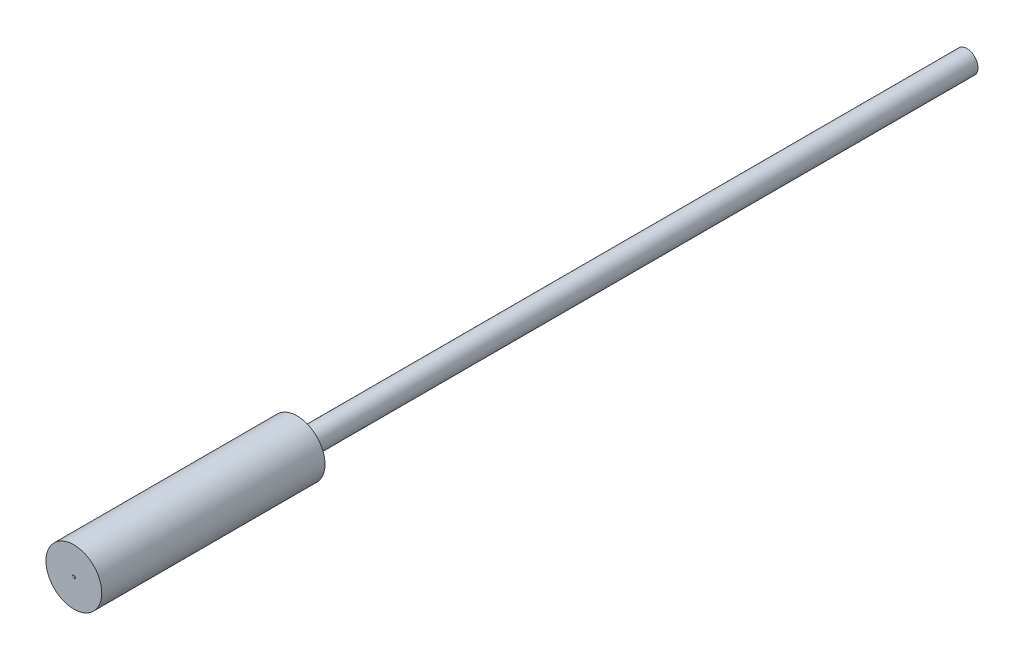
ISO-10303-21;
HEADER;
FILE_DESCRIPTION(('STEP AP214'),'2;1');
FILE_NAME('part.step','',(''),(''),'','','');
FILE_SCHEMA(('AUTOMOTIVE_DESIGN { 1 0 10303 214 1 1 1 1 }'));
ENDSEC;
DATA;
#1=APPLICATION_CONTEXT('core data for automotive mechanical design processes');
#2=APPLICATION_PROTOCOL_DEFINITION('international standard','automotive_design',2000,#1);
#3=PRODUCT_CONTEXT('',#1,'mechanical');
#4=PRODUCT('Part','Part','',(#3));
#5=PRODUCT_RELATED_PRODUCT_CATEGORY('part','',(#4));
#6=PRODUCT_DEFINITION_FORMATION('','',#4);
#7=PRODUCT_DEFINITION_CONTEXT('part definition',#1,'design');
#8=PRODUCT_DEFINITION('design','',#6,#7);
#9=PRODUCT_DEFINITION_SHAPE('','',#8);
#10=(LENGTH_UNIT() NAMED_UNIT(*) SI_UNIT(.MILLI.,.METRE.));
#11=(NAMED_UNIT(*) PLANE_ANGLE_UNIT() SI_UNIT($,.RADIAN.));
#12=(NAMED_UNIT(*) SI_UNIT($,.STERADIAN.) SOLID_ANGLE_UNIT());
#13=UNCERTAINTY_MEASURE_WITH_UNIT(LENGTH_MEASURE(1.E-05),#10,'distance_accuracy_value','');
#14=(GEOMETRIC_REPRESENTATION_CONTEXT(3) GLOBAL_UNCERTAINTY_ASSIGNED_CONTEXT((#13)) GLOBAL_UNIT_ASSIGNED_CONTEXT((#10,
#11,#12)) REPRESENTATION_CONTEXT('',''));
#15=CARTESIAN_POINT('',(0.,0.,0.));
#16=DIRECTION('',(0.,0.,1.));
#17=DIRECTION('',(1.,0.,0.));
#18=AXIS2_PLACEMENT_3D('',#15,#16,#17);
#19=CARTESIAN_POINT('',(0.,0.,-10.));
#20=DIRECTION('',(0.,0.,1.));
#21=DIRECTION('',(1.,0.,0.));
#22=AXIS2_PLACEMENT_3D('',#19,#20,#21);
#23=CYLINDRICAL_SURFACE('',#22,1.25);
#24=CARTESIAN_POINT('',(0.,0.,-10.));
#25=DIRECTION('',(0.,0.,1.));
#26=DIRECTION('',(1.,0.,0.));
#27=AXIS2_PLACEMENT_3D('',#24,#25,#26);
#28=CIRCLE('',#27,1.25);
#29=CARTESIAN_POINT('',(1.25,0.,-10.));
#30=VERTEX_POINT('',#29);
#31=EDGE_CURVE('E46',#30,#30,#28,.T.);
#32=ORIENTED_EDGE('',*,*,#31,.T.);
#33=EDGE_LOOP('',(#32));
#34=FACE_BOUND('',#33,.T.);
#35=CARTESIAN_POINT('',(0.,0.,0.));
#36=DIRECTION('',(0.,0.,1.));
#37=DIRECTION('',(1.,0.,0.));
#38=AXIS2_PLACEMENT_3D('',#35,#36,#37);
#39=CIRCLE('',#38,1.25);
#40=CARTESIAN_POINT('',(1.25,0.,0.));
#41=VERTEX_POINT('',#40);
#42=EDGE_CURVE('E41',#41,#41,#39,.T.);
#43=ORIENTED_EDGE('',*,*,#42,.F.);
#44=EDGE_LOOP('',(#43));
#45=FACE_BOUND('',#44,.T.);
#46=ADVANCED_FACE('F38',(#34,#45),#23,.T.);
#47=CARTESIAN_POINT('',(0.,0.,-10.));
#48=DIRECTION('',(0.,0.,1.));
#49=DIRECTION('',(1.,0.,0.));
#50=AXIS2_PLACEMENT_3D('',#47,#48,#49);
#51=PLANE('',#50);
#52=CARTESIAN_POINT('',(0.,0.,-10.));
#53=DIRECTION('',(0.,0.,-1.));
#54=DIRECTION('',(-1.,0.,0.));
#55=AXIS2_PLACEMENT_3D('',#52,#53,#54);
#56=CIRCLE('',#55,0.5);
#57=CARTESIAN_POINT('',(-0.5,0.,-10.));
#58=VERTEX_POINT('',#57);
#59=EDGE_CURVE('E10',#58,#58,#56,.T.);
#60=ORIENTED_EDGE('',*,*,#59,.F.);
#61=EDGE_LOOP('',(#60));
#62=FACE_BOUND('',#61,.T.);
#63=ORIENTED_EDGE('',*,*,#31,.F.);
#64=EDGE_LOOP('',(#63));
#65=FACE_BOUND('',#64,.T.);
#66=ADVANCED_FACE('F95',(#62,#65),#51,.F.);
#67=CARTESIAN_POINT('',(0.,0.,0.));
#68=DIRECTION('',(0.,0.,1.));
#69=DIRECTION('',(1.,0.,0.));
#70=AXIS2_PLACEMENT_3D('',#67,#68,#69);
#71=PLANE('',#70);
#72=CARTESIAN_POINT('',(0.,0.,0.));
#73=DIRECTION('',(0.,0.,1.));
#74=DIRECTION('',(1.,0.,0.));
#75=AXIS2_PLACEMENT_3D('',#72,#73,#74);
#76=CIRCLE('',#75,0.0675000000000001);
#77=CARTESIAN_POINT('',(0.0675000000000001,0.,0.));
#78=VERTEX_POINT('',#77);
#79=EDGE_CURVE('E59',#78,#78,#76,.T.);
#80=ORIENTED_EDGE('',*,*,#79,.F.);
#81=EDGE_LOOP('',(#80));
#82=FACE_BOUND('',#81,.T.);
#83=ORIENTED_EDGE('',*,*,#42,.T.);
#84=EDGE_LOOP('',(#83));
#85=FACE_BOUND('',#84,.T.);
#86=ADVANCED_FACE('F91',(#82,#85),#71,.T.);
#87=CARTESIAN_POINT('',(0.,0.,-40.));
#88=DIRECTION('',(0.,0.,1.));
#89=DIRECTION('',(1.,0.,0.));
#90=AXIS2_PLACEMENT_3D('',#87,#88,#89);
#91=CYLINDRICAL_SURFACE('',#90,0.5);
#92=CARTESIAN_POINT('',(0.,0.,-40.));
#93=DIRECTION('',(0.,0.,-1.));
#94=DIRECTION('',(-1.,0.,0.));
#95=AXIS2_PLACEMENT_3D('',#92,#93,#94);
#96=CIRCLE('',#95,0.5);
#97=CARTESIAN_POINT('',(-0.5,0.,-40.));
#98=VERTEX_POINT('',#97);
#99=EDGE_CURVE('E54',#98,#98,#96,.T.);
#100=ORIENTED_EDGE('',*,*,#99,.F.);
#101=EDGE_LOOP('',(#100));
#102=FACE_BOUND('',#101,.T.);
#103=ORIENTED_EDGE('',*,*,#59,.T.);
#104=EDGE_LOOP('',(#103));
#105=FACE_BOUND('',#104,.T.);
#106=ADVANCED_FACE('F94',(#102,#105),#91,.T.);
#107=CARTESIAN_POINT('',(0.,0.,-40.));
#108=DIRECTION('',(0.,0.,-1.));
#109=DIRECTION('',(-1.,0.,0.));
#110=AXIS2_PLACEMENT_3D('',#107,#108,#109);
#111=PLANE('',#110);
#112=ORIENTED_EDGE('',*,*,#99,.T.);
#113=EDGE_LOOP('',(#112));
#114=FACE_BOUND('',#113,.T.);
#115=ADVANCED_FACE('F87',(#114),#111,.T.);
#116=CARTESIAN_POINT('',(0.,0.,-0.1));
#117=DIRECTION('',(0.,0.,1.));
#118=DIRECTION('',(1.,0.,0.));
#119=AXIS2_PLACEMENT_3D('',#116,#117,#118);
#120=CYLINDRICAL_SURFACE('',#119,0.0675000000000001);
#121=CARTESIAN_POINT('',(0.,0.,-0.1));
#122=DIRECTION('',(0.,0.,1.));
#123=DIRECTION('',(1.,0.,0.));
#124=AXIS2_PLACEMENT_3D('',#121,#122,#123);
#125=CIRCLE('',#124,0.0675000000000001);
#126=CARTESIAN_POINT('',(0.0675000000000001,0.,-0.1));
#127=VERTEX_POINT('',#126);
#128=EDGE_CURVE('E58',#127,#127,#125,.T.);
#129=ORIENTED_EDGE('',*,*,#128,.F.);
#130=EDGE_LOOP('',(#129));
#131=FACE_BOUND('',#130,.T.);
#132=ORIENTED_EDGE('',*,*,#79,.T.);
#133=EDGE_LOOP('',(#132));
#134=FACE_BOUND('',#133,.T.);
#135=ADVANCED_FACE('F81',(#131,#134),#120,.F.);
#136=CARTESIAN_POINT('',(0.,0.,-0.1));
#137=DIRECTION('',(0.,0.,1.));
#138=DIRECTION('',(1.,0.,0.));
#139=AXIS2_PLACEMENT_3D('',#136,#137,#138);
#140=PLANE('',#139);
#141=CARTESIAN_POINT('',(0.,0.,-0.1));
#142=DIRECTION('',(0.,0.,1.));
#143=DIRECTION('',(1.,0.,0.));
#144=AXIS2_PLACEMENT_3D('',#141,#142,#143);
#145=CIRCLE('',#144,0.0624999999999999);
#146=CARTESIAN_POINT('',(0.0624999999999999,0.,-0.1));
#147=VERTEX_POINT('',#146);
#148=EDGE_CURVE('E63',#147,#147,#145,.T.);
#149=ORIENTED_EDGE('',*,*,#148,.F.);
#150=EDGE_LOOP('',(#149));
#151=FACE_BOUND('',#150,.T.);
#152=ORIENTED_EDGE('',*,*,#128,.T.);
#153=EDGE_LOOP('',(#152));
#154=FACE_BOUND('',#153,.T.);
#155=ADVANCED_FACE('F78',(#151,#154),#140,.T.);
#156=CARTESIAN_POINT('',(0.,0.,-0.1));
#157=DIRECTION('',(0.,0.,1.));
#158=DIRECTION('',(1.,0.,0.));
#159=AXIS2_PLACEMENT_3D('',#156,#157,#158);
#160=CYLINDRICAL_SURFACE('',#159,0.0624999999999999);
#161=ORIENTED_EDGE('',*,*,#148,.T.);
#162=EDGE_LOOP('',(#161));
#163=FACE_BOUND('',#162,.T.);
#164=CARTESIAN_POINT('',(0.,0.,0.));
#165=DIRECTION('',(0.,0.,1.));
#166=DIRECTION('',(1.,0.,0.));
#167=AXIS2_PLACEMENT_3D('',#164,#165,#166);
#168=CIRCLE('',#167,0.0624999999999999);
#169=CARTESIAN_POINT('',(0.0624999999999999,0.,0.));
#170=VERTEX_POINT('',#169);
#171=EDGE_CURVE('E66',#170,#170,#168,.T.);
#172=ORIENTED_EDGE('',*,*,#171,.F.);
#173=EDGE_LOOP('',(#172));
#174=FACE_BOUND('',#173,.T.);
#175=ADVANCED_FACE('F75',(#163,#174),#160,.T.);
#176=ORIENTED_EDGE('',*,*,#171,.T.);
#177=EDGE_LOOP('',(#176));
#178=FACE_BOUND('',#177,.T.);
#179=ADVANCED_FACE('F96',(#178),#71,.T.);
#180=CLOSED_SHELL('',(#46,#66,#86,#106,#115,#135,#155,#175,#179));
#181=MANIFOLD_SOLID_BREP('B2',#180);
#182=ADVANCED_BREP_SHAPE_REPRESENTATION('',(#18,#181),#14);
#183=SHAPE_DEFINITION_REPRESENTATION(#9,#182);
ENDSEC;
END-ISO-10303-21;
